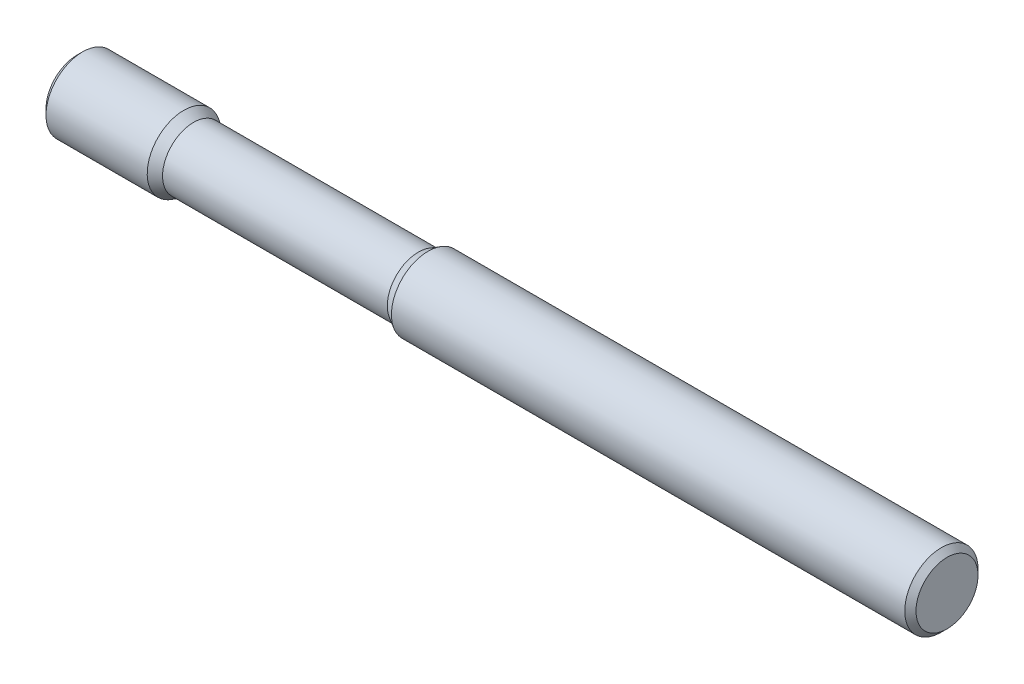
from build123d import *


with BuildPart() as part:
    # Esquisse1 → R_volution1 (revolve)
    with BuildSketch(Plane.XY):
        Polygon((0, 0), (0, 10.159695), (1.840305, 12), (35, 12), (38.187501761, 10.159695), (111.812498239, 10.159695), (115, 12), (283.159695, 12), (285, 10.159695), (285, 0), align=None)
    revolve(axis=Axis((285, 0, 0), (-1, 0, 0)))


solid = part.part
